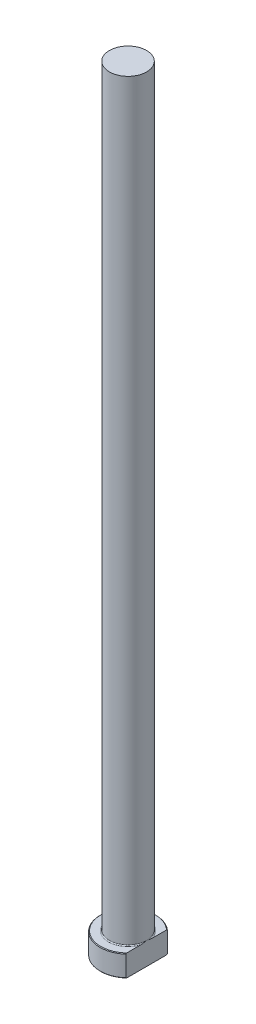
ISO-10303-21;
HEADER;
FILE_DESCRIPTION(('STEP AP214'),'2;1');
FILE_NAME('part.step','',(''),(''),'','','');
FILE_SCHEMA(('AUTOMOTIVE_DESIGN { 1 0 10303 214 1 1 1 1 }'));
ENDSEC;
DATA;
#1=APPLICATION_CONTEXT('core data for automotive mechanical design processes');
#2=APPLICATION_PROTOCOL_DEFINITION('international standard','automotive_design',2000,#1);
#3=PRODUCT_CONTEXT('',#1,'mechanical');
#4=PRODUCT('Part','Part','',(#3));
#5=PRODUCT_RELATED_PRODUCT_CATEGORY('part','',(#4));
#6=PRODUCT_DEFINITION_FORMATION('','',#4);
#7=PRODUCT_DEFINITION_CONTEXT('part definition',#1,'design');
#8=PRODUCT_DEFINITION('design','',#6,#7);
#9=PRODUCT_DEFINITION_SHAPE('','',#8);
#10=(LENGTH_UNIT() NAMED_UNIT(*) SI_UNIT(.MILLI.,.METRE.));
#11=(NAMED_UNIT(*) PLANE_ANGLE_UNIT() SI_UNIT($,.RADIAN.));
#12=(NAMED_UNIT(*) SI_UNIT($,.STERADIAN.) SOLID_ANGLE_UNIT());
#13=UNCERTAINTY_MEASURE_WITH_UNIT(LENGTH_MEASURE(1.E-05),#10,'distance_accuracy_value','');
#14=(GEOMETRIC_REPRESENTATION_CONTEXT(3) GLOBAL_UNCERTAINTY_ASSIGNED_CONTEXT((#13)) GLOBAL_UNIT_ASSIGNED_CONTEXT((#10,
#11,#12)) REPRESENTATION_CONTEXT('',''));
#15=CARTESIAN_POINT('',(0.,0.,0.));
#16=DIRECTION('',(0.,0.,1.));
#17=DIRECTION('',(1.,0.,0.));
#18=AXIS2_PLACEMENT_3D('',#15,#16,#17);
#19=CARTESIAN_POINT('',(0.,0.,0.));
#20=DIRECTION('',(0.,-1.,0.));
#21=DIRECTION('',(0.,0.,-1.));
#22=AXIS2_PLACEMENT_3D('',#19,#20,#21);
#23=PLANE('',#22);
#24=CARTESIAN_POINT('',(0.,0.,0.));
#25=DIRECTION('',(0.,-1.,0.));
#26=DIRECTION('',(0.,0.,-1.));
#27=AXIS2_PLACEMENT_3D('',#24,#25,#26);
#28=CIRCLE('',#27,8.79999999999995);
#29=CARTESIAN_POINT('',(5.99999999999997,0.,6.43739077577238));
#30=VERTEX_POINT('',#29);
#31=CARTESIAN_POINT('',(5.99999999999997,0.,-6.43739077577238));
#32=VERTEX_POINT('',#31);
#33=EDGE_CURVE('E98',#30,#32,#28,.T.);
#34=ORIENTED_EDGE('',*,*,#33,.T.);
#35=DIRECTION('',(0.,0.,1.));
#36=VECTOR('',#35,1.);
#37=CARTESIAN_POINT('',(5.99999999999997,0.,-6.70820393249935));
#38=LINE('',#37,#36);
#39=EDGE_CURVE('E83',#32,#30,#38,.T.);
#40=ORIENTED_EDGE('',*,*,#39,.T.);
#41=EDGE_LOOP('',(#34,#40));
#42=FACE_BOUND('',#41,.T.);
#43=ADVANCED_FACE('F32',(#42),#23,.T.);
#44=CARTESIAN_POINT('',(0.,259.958771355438,0.));
#45=DIRECTION('',(0.,1.,0.));
#46=DIRECTION('',(0.,0.,1.));
#47=AXIS2_PLACEMENT_3D('',#44,#45,#46);
#48=CYLINDRICAL_SURFACE('',#47,8.99999999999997);
#49=CARTESIAN_POINT('',(0.,6.79999999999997,0.));
#50=DIRECTION('',(0.,1.,0.));
#51=DIRECTION('',(0.,0.,1.));
#52=AXIS2_PLACEMENT_3D('',#49,#50,#51);
#53=CIRCLE('',#52,8.99999999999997);
#54=CARTESIAN_POINT('',(5.99999999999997,6.79999999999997,6.70820393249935));
#55=VERTEX_POINT('',#54);
#56=CARTESIAN_POINT('',(5.99999999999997,6.79999999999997,-6.70820393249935));
#57=VERTEX_POINT('',#56);
#58=EDGE_CURVE('E104',#55,#57,#53,.F.);
#59=ORIENTED_EDGE('',*,*,#58,.T.);
#60=DIRECTION('',(0.,-1.,0.));
#61=VECTOR('',#60,1.);
#62=CARTESIAN_POINT('',(5.99999999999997,250.,-6.70820393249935));
#63=LINE('',#62,#61);
#64=CARTESIAN_POINT('',(5.99999999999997,0.200000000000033,-6.70820393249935));
#65=VERTEX_POINT('',#64);
#66=EDGE_CURVE('E183',#57,#65,#63,.T.);
#67=ORIENTED_EDGE('',*,*,#66,.T.);
#68=CARTESIAN_POINT('',(0.,0.200000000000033,0.));
#69=DIRECTION('',(0.,-1.,0.));
#70=DIRECTION('',(0.,0.,-1.));
#71=AXIS2_PLACEMENT_3D('',#68,#69,#70);
#72=CIRCLE('',#71,8.99999999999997);
#73=CARTESIAN_POINT('',(5.99999999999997,0.200000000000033,6.70820393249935));
#74=VERTEX_POINT('',#73);
#75=EDGE_CURVE('E100',#65,#74,#72,.F.);
#76=ORIENTED_EDGE('',*,*,#75,.T.);
#77=DIRECTION('',(0.,-1.,0.));
#78=VECTOR('',#77,1.);
#79=CARTESIAN_POINT('',(5.99999999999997,250.,6.70820393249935));
#80=LINE('',#79,#78);
#81=EDGE_CURVE('E93',#55,#74,#80,.T.);
#82=ORIENTED_EDGE('',*,*,#81,.F.);
#83=EDGE_LOOP('',(#59,#67,#76,#82));
#84=FACE_BOUND('',#83,.T.);
#85=ADVANCED_FACE('F158',(#84),#48,.T.);
#86=CARTESIAN_POINT('',(-8.99999999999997,7.,0.));
#87=DIRECTION('',(0.,1.,0.));
#88=DIRECTION('',(0.,0.,1.));
#89=AXIS2_PLACEMENT_3D('',#86,#87,#88);
#90=PLANE('',#89);
#91=CARTESIAN_POINT('',(0.,7.,0.));
#92=DIRECTION('',(0.,1.,0.));
#93=DIRECTION('',(0.,0.,1.));
#94=AXIS2_PLACEMENT_3D('',#91,#92,#93);
#95=CIRCLE('',#94,8.79999999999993);
#96=CARTESIAN_POINT('',(5.99999999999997,7.,-6.43739077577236));
#97=VERTEX_POINT('',#96);
#98=CARTESIAN_POINT('',(5.99999999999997,7.,6.43739077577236));
#99=VERTEX_POINT('',#98);
#100=EDGE_CURVE('E178',#97,#99,#95,.T.);
#101=ORIENTED_EDGE('',*,*,#100,.T.);
#102=DIRECTION('',(0.,0.,-1.));
#103=VECTOR('',#102,1.);
#104=CARTESIAN_POINT('',(5.99999999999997,7.,0.));
#105=LINE('',#104,#103);
#106=CARTESIAN_POINT('',(5.99999999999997,6.99999999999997,1.92093727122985));
#107=VERTEX_POINT('',#106);
#108=EDGE_CURVE('E57',#99,#107,#105,.T.);
#109=ORIENTED_EDGE('',*,*,#108,.T.);
#110=CARTESIAN_POINT('',(0.,7.,0.));
#111=DIRECTION('',(0.,1.,0.));
#112=DIRECTION('',(0.,0.,1.));
#113=AXIS2_PLACEMENT_3D('',#110,#111,#112);
#114=CIRCLE('',#113,6.29999999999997);
#115=CARTESIAN_POINT('',(5.99999999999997,6.99999999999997,-1.92093727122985));
#116=VERTEX_POINT('',#115);
#117=EDGE_CURVE('E107',#107,#116,#114,.F.);
#118=ORIENTED_EDGE('',*,*,#117,.T.);
#119=EDGE_CURVE('E136',#116,#97,#105,.T.);
#120=ORIENTED_EDGE('',*,*,#119,.T.);
#121=EDGE_LOOP('',(#101,#109,#118,#120));
#122=FACE_BOUND('',#121,.T.);
#123=ADVANCED_FACE('F147',(#122),#90,.T.);
#124=CARTESIAN_POINT('',(0.,7.00000000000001,0.));
#125=DIRECTION('',(0.,-1.,0.));
#126=DIRECTION('',(0.,0.,-1.));
#127=AXIS2_PLACEMENT_3D('',#124,#125,#126);
#128=CONICAL_SURFACE('',#127,8.79999999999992,0.785398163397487);
#129=ORIENTED_EDGE('',*,*,#58,.F.);
#130=CARTESIAN_POINT('',(5.99999999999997,-0.132115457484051,14.7591430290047));
#131=CARTESIAN_POINT('',(5.99999999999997,0.0733919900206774,14.537299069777));
#132=CARTESIAN_POINT('',(5.99999999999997,0.278550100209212,14.3151315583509));
#133=CARTESIAN_POINT('',(5.99999999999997,0.688060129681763,13.8700519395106));
#134=CARTESIAN_POINT('',(5.99999999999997,0.892412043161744,13.647139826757));
#135=CARTESIAN_POINT('',(5.99999999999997,1.50418032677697,12.9770492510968));
#136=CARTESIAN_POINT('',(5.99999999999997,1.91022091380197,12.5286117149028));
#137=CARTESIAN_POINT('',(5.99999999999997,2.71980134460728,11.6246427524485));
#138=CARTESIAN_POINT('',(5.99999999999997,3.12331180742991,11.1690849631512));
#139=CARTESIAN_POINT('',(5.99999999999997,3.92341525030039,10.2520077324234));
#140=CARTESIAN_POINT('',(5.99999999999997,4.32000903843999,9.79048899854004));
#141=CARTESIAN_POINT('',(5.99999999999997,5.02478816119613,8.95241885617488));
#142=CARTESIAN_POINT('',(5.99999999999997,5.33476112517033,8.57737771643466));
#143=CARTESIAN_POINT('',(5.99999999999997,5.79310598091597,8.00939108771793));
#144=CARTESIAN_POINT('',(5.99999999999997,5.94480562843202,7.81913145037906));
#145=CARTESIAN_POINT('',(5.99999999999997,6.24553651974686,7.4365172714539));
#146=CARTESIAN_POINT('',(5.99999999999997,6.39456781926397,7.24416277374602));
#147=CARTESIAN_POINT('',(5.99999999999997,6.68925367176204,6.85721540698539));
#148=CARTESIAN_POINT('',(5.99999999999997,6.83491177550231,6.66262524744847));
#149=CARTESIAN_POINT('',(5.99999999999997,7.12230719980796,6.27057707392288));
#150=CARTESIAN_POINT('',(5.99999999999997,7.26404470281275,6.07311919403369));
#151=CARTESIAN_POINT('',(5.99999999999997,7.54263362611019,5.67488713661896));
#152=CARTESIAN_POINT('',(5.99999999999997,7.67948689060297,5.4741142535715));
#153=CARTESIAN_POINT('',(5.99999999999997,7.94714213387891,5.06858845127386));
#154=CARTESIAN_POINT('',(5.99999999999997,8.07794479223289,4.86383598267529));
#155=CARTESIAN_POINT('',(5.99999999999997,8.32827993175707,4.45554322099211));
#156=CARTESIAN_POINT('',(5.99999999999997,8.44802771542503,4.25213564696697));
#157=CARTESIAN_POINT('',(5.99999999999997,8.6783797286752,3.8401373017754));
#158=CARTESIAN_POINT('',(5.99999999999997,8.78898293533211,3.63154595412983));
#159=CARTESIAN_POINT('',(5.99999999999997,8.99840984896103,3.20863811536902));
#160=CARTESIAN_POINT('',(5.99999999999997,9.09724073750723,2.99432521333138));
#161=CARTESIAN_POINT('',(5.99999999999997,9.27991776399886,2.55937061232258));
#162=CARTESIAN_POINT('',(5.99999999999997,9.36376811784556,2.33873071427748));
#163=CARTESIAN_POINT('',(5.99999999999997,9.49627737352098,1.94012294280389));
#164=CARTESIAN_POINT('',(5.99999999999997,9.5486217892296,1.76338731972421));
#165=CARTESIAN_POINT('',(5.99999999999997,9.639780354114,1.40643307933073));
#166=CARTESIAN_POINT('',(5.99999999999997,9.67859618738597,1.22621489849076));
#167=CARTESIAN_POINT('',(5.99999999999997,9.7407731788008,0.863704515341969));
#168=CARTESIAN_POINT('',(5.99999999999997,9.76418479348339,0.681421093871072));
#169=CARTESIAN_POINT('',(5.99999999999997,9.79447814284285,0.315473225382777));
#170=CARTESIAN_POINT('',(5.99999999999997,9.80136083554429,0.131808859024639));
#171=CARTESIAN_POINT('',(5.99999999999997,9.79818788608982,-0.235881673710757));
#172=CARTESIAN_POINT('',(5.99999999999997,9.78808514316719,-0.419907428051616));
#173=CARTESIAN_POINT('',(5.99999999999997,9.75144464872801,-0.786302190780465));
#174=CARTESIAN_POINT('',(5.99999999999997,9.7249055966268,-0.968671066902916));
#175=CARTESIAN_POINT('',(5.99999999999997,9.65670736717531,-1.33110767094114));
#176=CARTESIAN_POINT('',(5.99999999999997,9.6150012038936,-1.5111664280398));
#177=CARTESIAN_POINT('',(5.99999999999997,9.51838325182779,-1.86766519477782));
#178=CARTESIAN_POINT('',(5.99999999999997,9.46347085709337,-2.04410503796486));
#179=CARTESIAN_POINT('',(5.99999999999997,9.33563659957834,-2.41270922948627));
#180=CARTESIAN_POINT('',(5.99999999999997,9.26138327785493,-2.60440790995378));
#181=CARTESIAN_POINT('',(5.99999999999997,9.10155310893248,-2.9830649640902));
#182=CARTESIAN_POINT('',(5.99999999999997,9.01597146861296,-3.17002129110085));
#183=CARTESIAN_POINT('',(5.99999999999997,8.8355347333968,-3.53975380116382));
#184=CARTESIAN_POINT('',(5.99999999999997,8.74066449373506,-3.72252253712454));
#185=CARTESIAN_POINT('',(5.99999999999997,8.54355472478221,-4.08398624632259));
#186=CARTESIAN_POINT('',(5.99999999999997,8.4413161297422,-4.26268173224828));
#187=CARTESIAN_POINT('',(5.99999999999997,8.22953960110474,-4.61872309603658));
#188=CARTESIAN_POINT('',(5.99999999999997,8.11992610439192,-4.79602381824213));
#189=CARTESIAN_POINT('',(5.99999999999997,7.89571048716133,-5.14743548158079));
#190=CARTESIAN_POINT('',(5.99999999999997,7.78110825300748,-5.32154634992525));
#191=CARTESIAN_POINT('',(5.99999999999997,7.54792782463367,-5.66682327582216));
#192=CARTESIAN_POINT('',(5.99999999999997,7.42935372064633,-5.83799210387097));
#193=CARTESIAN_POINT('',(5.99999999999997,7.18881616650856,-6.17793707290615));
#194=CARTESIAN_POINT('',(5.99999999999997,7.0668525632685,-6.34671310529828));
#195=CARTESIAN_POINT('',(5.99999999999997,6.80539778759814,-6.70216781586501));
#196=CARTESIAN_POINT('',(5.99999999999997,6.66554966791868,-6.88858356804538));
#197=CARTESIAN_POINT('',(5.99999999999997,6.38292065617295,-7.25918139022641));
#198=CARTESIAN_POINT('',(5.99999999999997,6.24013967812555,-7.44336339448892));
#199=CARTESIAN_POINT('',(5.99999999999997,5.80812002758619,-7.99307414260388));
#200=CARTESIAN_POINT('',(5.99999999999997,5.51523002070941,-8.35573349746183));
#201=CARTESIAN_POINT('',(5.99999999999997,4.92224619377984,-9.07562940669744));
#202=CARTESIAN_POINT('',(5.99999999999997,4.6221460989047,-9.432860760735));
#203=CARTESIAN_POINT('',(5.99999999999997,4.01677382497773,-10.1429201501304));
#204=CARTESIAN_POINT('',(5.99999999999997,3.71150152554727,-10.4957480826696));
#205=CARTESIAN_POINT('',(5.99999999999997,3.11456796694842,-11.1779164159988));
#206=CARTESIAN_POINT('',(5.99999999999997,2.82312451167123,-11.5074478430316));
#207=CARTESIAN_POINT('',(5.99999999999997,2.2374718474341,-12.164052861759));
#208=CARTESIAN_POINT('',(5.99999999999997,1.94326258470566,-12.491126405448));
#209=CARTESIAN_POINT('',(5.99999999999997,1.35320776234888,-13.1426363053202));
#210=CARTESIAN_POINT('',(5.99999999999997,1.0573664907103,-13.4670765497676));
#211=CARTESIAN_POINT('',(5.99999999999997,0.463882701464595,-14.1142803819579));
#212=CARTESIAN_POINT('',(5.99999999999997,0.166240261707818,-14.4370440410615));
#213=CARTESIAN_POINT('',(5.99999999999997,-0.132115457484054,-14.7591430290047));
#214=B_SPLINE_CURVE_WITH_KNOTS('',3,(#130,#131,#132,#133,#134,#135,#136,#137,#138,#139,#140,
#141,#142,#143,#144,#145,#146,#147,#148,#149,#150,#151,#152,#153,#154,#155,#156,#157,#158,#159,
#160,#161,#162,#163,#164,#165,#166,#167,#168,#169,#170,#171,#172,#173,#174,#175,#176,#177,#178,
#179,#180,#181,#182,#183,#184,#185,#186,#187,#188,#189,#190,#191,#192,#193,#194,#195,#196,#197,
#198,#199,#200,#201,#202,#203,#204,#205,#206,#207,#208,#209,#210,#211,#212,#213),.UNSPECIFIED.,
.F.,.F.,(4,2,2,2,2,2,2,2,2,2,2,2,2,2,2,2,2,2,2,2,2,2,2,2,2,2,2,2,2,2,2,2,2,2,2,2,2,2,2,2,2,4),
(0.,0.907210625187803,1.81442776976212,3.62925156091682,5.45490487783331,7.28034345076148,
8.73990838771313,9.46989218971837,10.1998607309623,10.9290223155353,11.6581499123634,
12.3869992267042,13.1157664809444,13.8236973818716,14.531707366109,15.2392832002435,
15.946659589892,16.4991819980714,17.0516356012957,17.6022705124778,18.152873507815,
18.7050058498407,19.2571818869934,19.811083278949,20.3650100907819,20.9812908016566,
21.5978331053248,22.2153979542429,22.8328846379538,23.4581285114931,24.0833866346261,
24.7080195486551,25.3326807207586,26.0317691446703,26.7308780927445,28.1292235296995,
29.5288334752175,30.9284760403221,32.2482200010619,33.5679896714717,34.8851960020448,
36.2023458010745),.UNSPECIFIED.);
#215=EDGE_CURVE('E135',#55,#99,#214,.T.);
#216=ORIENTED_EDGE('',*,*,#215,.T.);
#217=ORIENTED_EDGE('',*,*,#100,.F.);
#218=EDGE_CURVE('E127',#97,#57,#214,.T.);
#219=ORIENTED_EDGE('',*,*,#218,.T.);
#220=EDGE_LOOP('',(#129,#216,#217,#219));
#221=FACE_BOUND('',#220,.T.);
#222=ADVANCED_FACE('F143',(#221),#128,.T.);
#223=CARTESIAN_POINT('',(0.,0.200000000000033,0.));
#224=DIRECTION('',(0.,1.,0.));
#225=DIRECTION('',(0.,0.,1.));
#226=AXIS2_PLACEMENT_3D('',#223,#224,#225);
#227=CONICAL_SURFACE('',#226,8.99999999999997,0.785398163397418);
#228=ORIENTED_EDGE('',*,*,#75,.F.);
#229=CARTESIAN_POINT('',(5.99999999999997,7.13211545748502,-14.7591430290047));
#230=CARTESIAN_POINT('',(5.99999999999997,6.92660800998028,-14.537299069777));
#231=CARTESIAN_POINT('',(5.99999999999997,6.72144989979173,-14.315131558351));
#232=CARTESIAN_POINT('',(5.99999999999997,6.31193987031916,-13.8700519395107));
#233=CARTESIAN_POINT('',(5.99999999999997,6.10758795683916,-13.6471398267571));
#234=CARTESIAN_POINT('',(5.99999999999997,5.4958196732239,-12.9770492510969));
#235=CARTESIAN_POINT('',(5.99999999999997,5.08977908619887,-12.5286117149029));
#236=CARTESIAN_POINT('',(5.99999999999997,4.28019865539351,-11.6246427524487));
#237=CARTESIAN_POINT('',(5.99999999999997,3.87668819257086,-11.1690849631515));
#238=CARTESIAN_POINT('',(5.99999999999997,3.07658474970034,-10.2520077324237));
#239=CARTESIAN_POINT('',(5.99999999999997,2.67999096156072,-9.79048899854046));
#240=CARTESIAN_POINT('',(5.99999999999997,1.97521183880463,-8.95241885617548));
#241=CARTESIAN_POINT('',(5.99999999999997,1.66523887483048,-8.5773777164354));
#242=CARTESIAN_POINT('',(5.99999999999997,1.20689401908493,-8.00939108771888));
#243=CARTESIAN_POINT('',(5.99999999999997,1.05519437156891,-7.81913145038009));
#244=CARTESIAN_POINT('',(5.99999999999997,0.754463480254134,-7.43651727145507));
#245=CARTESIAN_POINT('',(5.99999999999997,0.60543218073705,-7.24416277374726));
#246=CARTESIAN_POINT('',(5.99999999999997,0.310746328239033,-6.85721540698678));
#247=CARTESIAN_POINT('',(5.99999999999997,0.165088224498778,-6.66262524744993));
#248=CARTESIAN_POINT('',(5.99999999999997,-0.122307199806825,-6.2705770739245));
#249=CARTESIAN_POINT('',(5.99999999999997,-0.2640447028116,-6.07311919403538));
#250=CARTESIAN_POINT('',(5.99999999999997,-0.542633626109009,-5.67488713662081));
#251=CARTESIAN_POINT('',(5.99999999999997,-0.679486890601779,-5.47411425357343));
#252=CARTESIAN_POINT('',(5.99999999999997,-0.947142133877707,-5.06858845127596));
#253=CARTESIAN_POINT('',(5.99999999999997,-1.07794479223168,-4.86383598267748));
#254=CARTESIAN_POINT('',(5.99999999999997,-1.32827993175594,-4.45554322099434));
#255=CARTESIAN_POINT('',(5.99999999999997,-1.44802771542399,-4.25213564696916));
#256=CARTESIAN_POINT('',(5.99999999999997,-1.67837972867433,-3.8401373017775));
#257=CARTESIAN_POINT('',(5.99999999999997,-1.78898293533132,-3.63154595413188));
#258=CARTESIAN_POINT('',(5.99999999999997,-1.99840984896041,-3.20863811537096));
#259=CARTESIAN_POINT('',(5.99999999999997,-2.0972407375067,-2.99432521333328));
#260=CARTESIAN_POINT('',(5.99999999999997,-2.2799177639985,-2.55937061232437));
#261=CARTESIAN_POINT('',(5.99999999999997,-2.36376811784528,-2.33873071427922));
#262=CARTESIAN_POINT('',(5.99999999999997,-2.49627737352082,-1.94012294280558));
#263=CARTESIAN_POINT('',(5.99999999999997,-2.54862178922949,-1.76338731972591));
#264=CARTESIAN_POINT('',(5.99999999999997,-2.63978035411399,-1.40643307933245));
#265=CARTESIAN_POINT('',(5.99999999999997,-2.67859618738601,-1.22621489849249));
#266=CARTESIAN_POINT('',(5.99999999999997,-2.74077317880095,-0.863704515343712));
#267=CARTESIAN_POINT('',(5.99999999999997,-2.7641847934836,-0.681421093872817));
#268=CARTESIAN_POINT('',(5.99999999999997,-2.79447814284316,-0.315473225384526));
#269=CARTESIAN_POINT('',(5.99999999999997,-2.80136083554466,-0.131808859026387));
#270=CARTESIAN_POINT('',(5.99999999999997,-2.7981878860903,0.23588167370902));
#271=CARTESIAN_POINT('',(5.99999999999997,-2.78808514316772,0.419907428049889));
#272=CARTESIAN_POINT('',(5.99999999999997,-2.75144464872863,0.786302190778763));
#273=CARTESIAN_POINT('',(5.99999999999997,-2.72490559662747,0.968671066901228));
#274=CARTESIAN_POINT('',(5.99999999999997,-2.65670736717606,1.33110767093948));
#275=CARTESIAN_POINT('',(5.99999999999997,-2.61500120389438,1.51116642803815));
#276=CARTESIAN_POINT('',(5.99999999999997,-2.51838325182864,1.8676651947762));
#277=CARTESIAN_POINT('',(5.99999999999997,-2.46347085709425,2.04410503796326));
#278=CARTESIAN_POINT('',(5.99999999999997,-2.33563659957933,2.41270922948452));
#279=CARTESIAN_POINT('',(5.99999999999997,-2.26138327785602,2.60440790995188));
#280=CARTESIAN_POINT('',(5.99999999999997,-2.10155310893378,2.98306496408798));
#281=CARTESIAN_POINT('',(5.99999999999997,-2.01597146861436,3.17002129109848));
#282=CARTESIAN_POINT('',(5.99999999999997,-1.83553473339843,3.53975380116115));
#283=CARTESIAN_POINT('',(5.99999999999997,-1.74066449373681,3.72252253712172));
#284=CARTESIAN_POINT('',(5.99999999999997,-1.5435547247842,4.08398624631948));
#285=CARTESIAN_POINT('',(5.99999999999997,-1.44131612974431,4.26268173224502));
#286=CARTESIAN_POINT('',(5.99999999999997,-1.22953960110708,4.61872309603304));
#287=CARTESIAN_POINT('',(5.99999999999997,-1.11992610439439,4.79602381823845));
#288=CARTESIAN_POINT('',(5.99999999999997,-0.895710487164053,5.14743548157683));
#289=CARTESIAN_POINT('',(5.99999999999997,-0.781108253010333,5.32154634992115));
#290=CARTESIAN_POINT('',(5.99999999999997,-0.547927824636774,5.66682327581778));
#291=CARTESIAN_POINT('',(5.99999999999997,-0.429353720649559,5.83799210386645));
#292=CARTESIAN_POINT('',(5.99999999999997,-0.188816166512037,6.17793707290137));
#293=CARTESIAN_POINT('',(5.99999999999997,-0.0668525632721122,6.34671310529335));
#294=CARTESIAN_POINT('',(5.99999999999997,0.194602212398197,6.7021678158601));
#295=CARTESIAN_POINT('',(5.99999999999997,0.334450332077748,6.88858356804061));
#296=CARTESIAN_POINT('',(5.99999999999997,0.617079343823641,7.25918139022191));
#297=CARTESIAN_POINT('',(5.99999999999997,0.759860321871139,7.44336339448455));
#298=CARTESIAN_POINT('',(5.99999999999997,1.19187997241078,7.99307414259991));
#299=CARTESIAN_POINT('',(5.99999999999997,1.48476997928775,8.35573349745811));
#300=CARTESIAN_POINT('',(5.99999999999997,2.07775380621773,9.07562940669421));
#301=CARTESIAN_POINT('',(5.99999999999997,2.37785390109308,9.43286076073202));
#302=CARTESIAN_POINT('',(5.99999999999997,2.9832261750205,10.1429201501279));
#303=CARTESIAN_POINT('',(5.99999999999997,3.28849847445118,10.4957480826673));
#304=CARTESIAN_POINT('',(5.99999999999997,3.88543203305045,11.1779164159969));
#305=CARTESIAN_POINT('',(5.99999999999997,4.17687548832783,11.5074478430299));
#306=CARTESIAN_POINT('',(5.99999999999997,4.76252815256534,12.1640528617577));
#307=CARTESIAN_POINT('',(5.99999999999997,5.05673741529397,12.4911264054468));
#308=CARTESIAN_POINT('',(5.99999999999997,5.64679223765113,13.1426363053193));
#309=CARTESIAN_POINT('',(5.99999999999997,5.9426335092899,13.4670765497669));
#310=CARTESIAN_POINT('',(5.99999999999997,6.53611729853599,14.1142803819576));
#311=CARTESIAN_POINT('',(5.99999999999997,6.83375973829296,14.4370440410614));
#312=CARTESIAN_POINT('',(5.99999999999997,7.13211545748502,14.7591430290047));
#313=B_SPLINE_CURVE_WITH_KNOTS('',3,(#229,#230,#231,#232,#233,#234,#235,#236,#237,#238,#239,
#240,#241,#242,#243,#244,#245,#246,#247,#248,#249,#250,#251,#252,#253,#254,#255,#256,#257,#258,
#259,#260,#261,#262,#263,#264,#265,#266,#267,#268,#269,#270,#271,#272,#273,#274,#275,#276,#277,
#278,#279,#280,#281,#282,#283,#284,#285,#286,#287,#288,#289,#290,#291,#292,#293,#294,#295,#296,
#297,#298,#299,#300,#301,#302,#303,#304,#305,#306,#307,#308,#309,#310,#311,#312),.UNSPECIFIED.,
.F.,.F.,(4,2,2,2,2,2,2,2,2,2,2,2,2,2,2,2,2,2,2,2,2,2,2,2,2,2,2,2,2,2,2,2,2,2,2,2,2,2,2,2,2,4),
(0.,0.907210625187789,1.81442776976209,3.62925156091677,5.45490487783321,7.28034345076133,
8.73990838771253,9.46989218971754,10.1998607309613,10.9290223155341,11.6581499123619,
12.3869992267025,13.1157664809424,13.82369738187,14.5317073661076,15.2392832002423,
15.9466595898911,16.4991819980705,17.0516356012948,17.6022705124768,18.1528735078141,
18.7050058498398,19.2571818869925,19.8110832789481,20.365010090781,20.9812908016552,
21.5978331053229,22.2153979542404,22.8328846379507,23.4581285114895,24.083386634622,
24.7080195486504,25.3326807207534,26.0317691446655,26.7308780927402,28.1292235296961,
29.5288334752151,30.9284760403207,32.2482200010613,33.5679896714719,34.8851960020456,
36.2023458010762),.UNSPECIFIED.);
#314=EDGE_CURVE('E86',#65,#32,#313,.T.);
#315=ORIENTED_EDGE('',*,*,#314,.T.);
#316=ORIENTED_EDGE('',*,*,#33,.F.);
#317=EDGE_CURVE('E89',#30,#74,#313,.T.);
#318=ORIENTED_EDGE('',*,*,#317,.T.);
#319=EDGE_LOOP('',(#228,#315,#316,#318));
#320=FACE_BOUND('',#319,.T.);
#321=ADVANCED_FACE('F97',(#320),#227,.T.);
#322=CARTESIAN_POINT('',(0.,7.29999999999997,0.));
#323=DIRECTION('',(0.,1.,0.));
#324=DIRECTION('',(0.,0.,1.));
#325=AXIS2_PLACEMENT_3D('',#322,#323,#324);
#326=TOROIDAL_SURFACE('',#325,6.29999999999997,0.3);
#327=CARTESIAN_POINT('',(5.99999999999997,7.29999999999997,0.));
#328=CARTESIAN_POINT('',(5.99999999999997,7.30000062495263,1.34604287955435E-10));
#329=CARTESIAN_POINT('',(5.99999999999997,7.30000124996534,-2.85495107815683E-07));
#330=CARTESIAN_POINT('',(5.99999999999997,7.30000241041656,-1.04928090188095E-06));
#331=CARTESIAN_POINT('',(5.99999999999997,7.30000292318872,-1.54785170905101E-06));
#332=CARTESIAN_POINT('',(5.99999999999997,7.30000401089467,-2.74944383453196E-06));
#333=CARTESIAN_POINT('',(5.99999999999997,7.30000456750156,-3.47196539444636E-06));
#334=CARTESIAN_POINT('',(5.99999999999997,7.30000554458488,-4.95172582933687E-06));
#335=CARTESIAN_POINT('',(5.99999999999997,7.30000596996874,-5.70604365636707E-06));
#336=CARTESIAN_POINT('',(5.99999999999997,7.30000759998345,-8.69525109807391E-06));
#337=CARTESIAN_POINT('',(5.99999999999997,7.30000872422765,-1.0978182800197E-05));
#338=CARTESIAN_POINT('',(5.99999999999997,7.30001052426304,-1.54456346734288E-05));
#339=CARTESIAN_POINT('',(5.99999999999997,7.3000112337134,-1.76170762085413E-05));
#340=CARTESIAN_POINT('',(5.99999999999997,7.30001429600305,-2.69928123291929E-05));
#341=CARTESIAN_POINT('',(5.99999999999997,7.30001664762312,-3.42000265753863E-05));
#342=CARTESIAN_POINT('',(5.99999999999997,7.30002002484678,-4.76829001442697E-05));
#343=CARTESIAN_POINT('',(5.99999999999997,7.30002120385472,-5.39195609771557E-05));
#344=CARTESIAN_POINT('',(5.99999999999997,7.30002992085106,-0.000100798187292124));
#345=CARTESIAN_POINT('',(5.99999999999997,7.30003667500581,-0.00014152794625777));
#346=CARTESIAN_POINT('',(5.99999999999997,7.30006623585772,-0.000303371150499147));
#347=CARTESIAN_POINT('',(5.99999999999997,7.30009428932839,-0.000423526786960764));
#348=CARTESIAN_POINT('',(5.99999999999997,7.30020425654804,-0.000901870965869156));
#349=CARTESIAN_POINT('',(5.99999999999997,7.3002828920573,-0.00126055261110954));
#350=CARTESIAN_POINT('',(5.99999999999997,7.30059934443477,-0.0026940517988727));
#351=CARTESIAN_POINT('',(5.99999999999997,7.3008413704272,-0.0037682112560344));
#352=CARTESIAN_POINT('',(5.99999999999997,7.30185255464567,-0.0082672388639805));
#353=CARTESIAN_POINT('',(5.99999999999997,7.30261638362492,-0.0116929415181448));
#354=CARTESIAN_POINT('',(5.99999999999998,7.30945824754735,-0.0423635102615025));
#355=CARTESIAN_POINT('',(5.99999999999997,7.31555811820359,-0.0696050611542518));
#356=CARTESIAN_POINT('',(5.99999999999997,7.32747716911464,-0.122985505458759));
#357=CARTESIAN_POINT('',(5.99999999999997,7.33329766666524,-0.149124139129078));
#358=CARTESIAN_POINT('',(5.99999999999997,7.34565922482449,-0.204790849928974));
#359=CARTESIAN_POINT('',(5.99999999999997,7.352196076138,-0.234319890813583));
#360=CARTESIAN_POINT('',(5.99999999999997,7.36527652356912,-0.29372170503));
#361=CARTESIAN_POINT('',(5.99999999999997,7.37181938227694,-0.323594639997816));
#362=CARTESIAN_POINT('',(5.99999999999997,7.38741819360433,-0.395325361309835));
#363=CARTESIAN_POINT('',(5.99999999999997,7.39643140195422,-0.437192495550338));
#364=CARTESIAN_POINT('',(5.99999999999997,7.41397520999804,-0.519837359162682));
#365=CARTESIAN_POINT('',(5.99999999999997,7.4225122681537,-0.560613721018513));
#366=CARTESIAN_POINT('',(5.99999999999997,7.45005469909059,-0.694529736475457));
#367=CARTESIAN_POINT('',(5.99999999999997,7.46845270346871,-0.787796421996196));
#368=CARTESIAN_POINT('',(5.99999999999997,7.50309772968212,-0.975673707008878));
#369=CARTESIAN_POINT('',(5.99999999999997,7.51932210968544,-1.07028855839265));
#370=CARTESIAN_POINT('',(5.99999999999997,7.54979671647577,-1.26922112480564));
#371=CARTESIAN_POINT('',(5.99999999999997,7.56370439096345,-1.37359247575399));
#372=CARTESIAN_POINT('',(5.99999999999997,7.58567213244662,-1.58267692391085));
#373=CARTESIAN_POINT('',(5.99999999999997,7.59375049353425,-1.68738790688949));
#374=CARTESIAN_POINT('',(5.99999999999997,7.59943466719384,-1.8430899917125));
#375=CARTESIAN_POINT('',(5.99999999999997,7.60029184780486,-1.89396002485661));
#376=CARTESIAN_POINT('',(5.99999999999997,7.5995288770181,-1.99574511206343));
#377=CARTESIAN_POINT('',(5.99999999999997,7.59790613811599,-2.04666015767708));
#378=CARTESIAN_POINT('',(5.99999999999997,7.59158346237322,-2.14740525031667));
#379=CARTESIAN_POINT('',(5.99999999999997,7.58693864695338,-2.19723851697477));
#380=CARTESIAN_POINT('',(5.99999999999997,7.57369485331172,-2.29634018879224));
#381=CARTESIAN_POINT('',(5.99999999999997,7.56510170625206,-2.3456093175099));
#382=CARTESIAN_POINT('',(5.99999999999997,7.54513600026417,-2.43101613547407));
#383=CARTESIAN_POINT('',(5.99999999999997,7.53495732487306,-2.46741817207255));
#384=CARTESIAN_POINT('',(5.99999999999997,7.5163599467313,-2.52083307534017));
#385=CARTESIAN_POINT('',(5.99999999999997,7.50961541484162,-2.53842082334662));
#386=CARTESIAN_POINT('',(5.99999999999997,7.49476050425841,-2.57300282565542));
#387=CARTESIAN_POINT('',(5.99999999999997,7.48665036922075,-2.58999718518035));
#388=CARTESIAN_POINT('',(5.99999999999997,7.4656679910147,-2.62872971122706));
#389=CARTESIAN_POINT('',(5.99999999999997,7.45211281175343,-2.65012863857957));
#390=CARTESIAN_POINT('',(5.99999999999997,7.42848584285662,-2.67978235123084));
#391=CARTESIAN_POINT('',(5.99999999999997,7.42001211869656,-2.68929941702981));
#392=CARTESIAN_POINT('',(5.99999999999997,7.40175979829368,-2.70700164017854));
#393=CARTESIAN_POINT('',(5.99999999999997,7.39198420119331,-2.71518976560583));
#394=CARTESIAN_POINT('',(5.99999999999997,7.37475773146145,-2.7269570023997));
#395=CARTESIAN_POINT('',(5.99999999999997,7.36772137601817,-2.73113834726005));
#396=CARTESIAN_POINT('',(5.99999999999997,7.35309194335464,-2.73838811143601));
#397=CARTESIAN_POINT('',(5.99999999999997,7.34549938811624,-2.7414575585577));
#398=CARTESIAN_POINT('',(5.99999999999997,7.32979919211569,-2.74623687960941));
#399=CARTESIAN_POINT('',(5.99999999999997,7.32168697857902,-2.74793213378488));
#400=CARTESIAN_POINT('',(5.99999999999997,7.30528814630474,-2.74970225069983));
#401=CARTESIAN_POINT('',(5.99999999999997,7.29700168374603,-2.74977850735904));
#402=CARTESIAN_POINT('',(5.99999999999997,7.2816016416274,-2.74839814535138));
#403=CARTESIAN_POINT('',(5.99999999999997,7.27447007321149,-2.74713049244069));
#404=CARTESIAN_POINT('',(5.99999999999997,7.26050316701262,-2.74347158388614));
#405=CARTESIAN_POINT('',(5.99999999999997,7.25366802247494,-2.7410796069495));
#406=CARTESIAN_POINT('',(5.99999999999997,7.23783277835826,-2.73423902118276));
#407=CARTESIAN_POINT('',(5.99999999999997,7.22902314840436,-2.72935244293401));
#408=CARTESIAN_POINT('',(5.99999999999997,7.21228574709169,-2.7182516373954));
#409=CARTESIAN_POINT('',(5.99999999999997,7.20436026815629,-2.71203407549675));
#410=CARTESIAN_POINT('',(5.99999999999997,7.18433696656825,-2.69420240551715));
#411=CARTESIAN_POINT('',(5.99999999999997,7.17298706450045,-2.68175715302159));
#412=CARTESIAN_POINT('',(5.99999999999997,7.15219498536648,-2.65539556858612));
#413=CARTESIAN_POINT('',(5.99999999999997,7.14275658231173,-2.64147640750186));
#414=CARTESIAN_POINT('',(5.99999999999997,7.12508934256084,-2.61223187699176));
#415=CARTESIAN_POINT('',(5.99999999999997,7.11691464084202,-2.59687428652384));
#416=CARTESIAN_POINT('',(5.99999999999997,7.10186133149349,-2.56552911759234));
#417=CARTESIAN_POINT('',(5.99999999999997,7.09498416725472,-2.54954086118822));
#418=CARTESIAN_POINT('',(5.99999999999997,7.07586257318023,-2.50075322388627));
#419=CARTESIAN_POINT('',(5.99999999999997,7.06523495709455,-2.46732486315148));
#420=CARTESIAN_POINT('',(5.99999999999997,7.04175411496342,-2.38014114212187));
#421=CARTESIAN_POINT('',(5.99999999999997,7.0311656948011,-2.32580591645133));
#422=CARTESIAN_POINT('',(5.99999999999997,7.01502027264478,-2.21628778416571));
#423=CARTESIAN_POINT('',(5.99999999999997,7.00947977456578,-2.16110269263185));
#424=CARTESIAN_POINT('',(5.99999999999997,7.00227593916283,-2.05225433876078));
#425=CARTESIAN_POINT('',(5.99999999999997,7.00049528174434,-1.99859827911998));
#426=CARTESIAN_POINT('',(5.99999999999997,6.99968738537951,-1.89155586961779));
#427=CARTESIAN_POINT('',(5.99999999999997,7.00064591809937,-1.83816956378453));
#428=CARTESIAN_POINT('',(5.99999999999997,7.00516082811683,-1.72092619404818));
#429=CARTESIAN_POINT('',(5.99999999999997,7.0091939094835,-1.65708843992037));
#430=CARTESIAN_POINT('',(5.99999999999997,7.01973827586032,-1.52965474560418));
#431=CARTESIAN_POINT('',(5.99999999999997,7.02624848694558,-1.46605871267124));
#432=CARTESIAN_POINT('',(5.99999999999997,7.04143114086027,-1.33760082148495));
#433=CARTESIAN_POINT('',(5.99999999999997,7.05015116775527,-1.27274468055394));
#434=CARTESIAN_POINT('',(5.99999999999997,7.06927542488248,-1.14310871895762));
#435=CARTESIAN_POINT('',(5.99999999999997,7.07968406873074,-1.07832955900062));
#436=CARTESIAN_POINT('',(5.99999999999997,7.10594320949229,-0.924890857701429));
#437=CARTESIAN_POINT('',(5.99999999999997,7.12237584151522,-0.836331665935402));
#438=CARTESIAN_POINT('',(5.99999999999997,7.15676035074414,-0.660568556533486));
#439=CARTESIAN_POINT('',(5.99999999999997,7.17469265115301,-0.573360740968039));
#440=CARTESIAN_POINT('',(5.99999999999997,7.20946366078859,-0.409309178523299));
#441=CARTESIAN_POINT('',(5.99999999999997,7.22618667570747,-0.332440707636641));
#442=CARTESIAN_POINT('',(5.99999999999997,7.25202386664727,-0.215187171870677));
#443=CARTESIAN_POINT('',(5.99999999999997,7.26098977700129,-0.174768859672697));
#444=CARTESIAN_POINT('',(5.99999999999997,7.27885525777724,-0.0946083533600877));
#445=CARTESIAN_POINT('',(5.99999999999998,7.28775352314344,-0.0548658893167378));
#446=CARTESIAN_POINT('',(5.99999999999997,7.2973853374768,-0.0116849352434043));
#447=CARTESIAN_POINT('',(5.99999999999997,7.29815099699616,-0.0082512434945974));
#448=CARTESIAN_POINT('',(5.99999999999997,7.2991626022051,-0.00375043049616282));
#449=CARTESIAN_POINT('',(5.99999999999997,7.29940322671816,-0.00268247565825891));
#450=CARTESIAN_POINT('',(5.99999999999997,7.29971797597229,-0.0012566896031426));
#451=CARTESIAN_POINT('',(5.99999999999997,7.2997962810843,-0.000899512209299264));
#452=CARTESIAN_POINT('',(5.99999999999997,7.2999058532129,-0.000422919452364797));
#453=CARTESIAN_POINT('',(5.99999999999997,7.29993385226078,-0.000303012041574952));
#454=CARTESIAN_POINT('',(5.99999999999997,7.299963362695,-0.000141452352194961));
#455=CARTESIAN_POINT('',(5.99999999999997,7.29997011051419,-0.000100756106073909));
#456=CARTESIAN_POINT('',(5.99999999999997,7.29997881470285,-5.39118915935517E-05));
#457=CARTESIAN_POINT('',(5.99999999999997,7.29997999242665,-4.76769647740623E-05));
#458=CARTESIAN_POINT('',(5.99999999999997,7.29998336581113,-3.41977669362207E-05));
#459=CARTESIAN_POINT('',(5.99999999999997,7.29998571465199,-2.69924043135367E-05));
#460=CARTESIAN_POINT('',(5.99999999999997,7.29998877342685,-1.76186229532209E-05));
#461=CARTESIAN_POINT('',(5.99999999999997,7.29998948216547,-1.54473107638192E-05));
#462=CARTESIAN_POINT('',(5.99999999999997,7.29999128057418,-1.09800124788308E-05));
#463=CARTESIAN_POINT('',(5.99999999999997,7.29999240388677,-8.69708706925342E-06));
#464=CARTESIAN_POINT('',(5.99999999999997,7.29999403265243,-5.70776681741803E-06));
#465=CARTESIAN_POINT('',(5.99999999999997,7.29999445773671,-4.95337952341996E-06));
#466=CARTESIAN_POINT('',(5.99999999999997,7.29999543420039,-3.47342608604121E-06));
#467=CARTESIAN_POINT('',(5.99999999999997,7.29999599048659,-2.7507782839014E-06));
#468=CARTESIAN_POINT('',(5.99999999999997,7.29999707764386,-1.54889527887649E-06));
#469=CARTESIAN_POINT('',(5.99999999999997,7.29999759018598,-1.0501721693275E-06));
#470=CARTESIAN_POINT('',(5.99999999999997,7.29999875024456,-2.85992424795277E-07));
#471=CARTESIAN_POINT('',(5.99999999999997,7.29999937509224,-1.34594612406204E-10));
#472=CARTESIAN_POINT('',(5.99999999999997,7.29999999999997,0.));
#473=B_SPLINE_CURVE_WITH_KNOTS('',3,(#327,#328,#329,#330,#331,#332,#333,#334,#335,#336,#337,
#338,#339,#340,#341,#342,#343,#344,#345,#346,#347,#348,#349,#350,#351,#352,#353,#354,#355,#356,
#357,#358,#359,#360,#361,#362,#363,#364,#365,#366,#367,#368,#369,#370,#371,#372,#373,#374,#375,
#376,#377,#378,#379,#380,#381,#382,#383,#384,#385,#386,#387,#388,#389,#390,#391,#392,#393,#394,
#395,#396,#397,#398,#399,#400,#401,#402,#403,#404,#405,#406,#407,#408,#409,#410,#411,#412,#413,
#414,#415,#416,#417,#418,#419,#420,#421,#422,#423,#424,#425,#426,#427,#428,#429,#430,#431,#432,
#433,#434,#435,#436,#437,#438,#439,#440,#441,#442,#443,#444,#445,#446,#447,#448,#449,#450,#451,
#452,#453,#454,#455,#456,#457,#458,#459,#460,#461,#462,#463,#464,#465,#466,#467,#468,#469,#470,
#471,#472),.UNSPECIFIED.,.T.,.F.,(4,2,2,2,2,2,2,2,2,2,2,2,2,2,2,2,2,2,2,2,2,2,2,2,2,2,2,2,2,2,2,
2,2,2,2,2,2,2,2,2,2,2,2,2,2,2,2,2,2,2,2,2,2,2,2,2,2,2,2,2,2,2,2,2,2,2,2,2,2,2,2,2,4),(0.,
1.90630853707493E-06,4.0638928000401E-06,6.78060422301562E-06,9.37792731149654E-06,
1.69875448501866E-05,2.38342815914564E-05,4.65460519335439E-05,6.55661832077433E-05,
0.000189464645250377,0.000559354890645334,0.001661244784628,0.00496415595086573,
0.0154940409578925,0.0992404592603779,0.179577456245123,0.270309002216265,0.362052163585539,
0.490530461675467,0.615511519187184,0.900684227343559,1.1886283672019,1.50441328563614,
1.8192028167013,1.97178950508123,2.1245355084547,2.27457076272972,2.4243851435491,
2.53755667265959,2.59401506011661,2.65046338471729,2.72600079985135,2.76413970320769,
2.80219221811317,2.82667181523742,2.85112872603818,2.8758425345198,2.90053506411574,
2.92216471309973,2.94380825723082,2.97385970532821,3.00398734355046,3.05423323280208,
3.10457737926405,3.15668997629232,3.20886020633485,3.31385890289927,3.47955406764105,
3.64578904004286,3.80675522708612,3.96688682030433,4.15871791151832,4.35046593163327,
4.54675795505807,4.74357155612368,5.01375693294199,5.2808448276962,5.51684158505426,
5.64104475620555,5.76322108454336,5.77377554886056,5.77705938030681,5.77815664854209,
5.77852577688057,5.77864957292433,5.77866858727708,5.77869129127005,5.77869813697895,
5.77870574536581,5.77870834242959,5.77871105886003,5.77871321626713,5.77871512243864),.UNSPECIFIED.);
#474=CARTESIAN_POINT('',(5.99999999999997,7.29999999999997,0.));
#475=VERTEX_POINT('',#474);
#476=EDGE_CURVE('E11',#116,#475,#473,.T.);
#477=ORIENTED_EDGE('',*,*,#476,.F.);
#478=ORIENTED_EDGE('',*,*,#117,.F.);
#479=CARTESIAN_POINT('',(5.99999999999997,7.29999999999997,0.));
#480=CARTESIAN_POINT('',(5.99999999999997,7.29999937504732,-1.34604253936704E-10));
#481=CARTESIAN_POINT('',(5.99999999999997,7.29999875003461,2.85495107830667E-07));
#482=CARTESIAN_POINT('',(5.99999999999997,7.29999758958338,1.04928090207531E-06));
#483=CARTESIAN_POINT('',(5.99999999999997,7.29999707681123,1.54785170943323E-06));
#484=CARTESIAN_POINT('',(5.99999999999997,7.29999598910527,2.74944383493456E-06));
#485=CARTESIAN_POINT('',(5.99999999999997,7.29999543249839,3.47196539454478E-06));
#486=CARTESIAN_POINT('',(5.99999999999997,7.29999445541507,4.95172582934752E-06));
#487=CARTESIAN_POINT('',(5.99999999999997,7.29999403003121,5.70604365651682E-06));
#488=CARTESIAN_POINT('',(5.99999999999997,7.2999924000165,8.69525109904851E-06));
#489=CARTESIAN_POINT('',(5.99999999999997,7.2999912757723,1.09781828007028E-05));
#490=CARTESIAN_POINT('',(5.99999999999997,7.29998947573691,1.54456346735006E-05));
#491=CARTESIAN_POINT('',(5.99999999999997,7.29998876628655,1.76170762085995E-05));
#492=CARTESIAN_POINT('',(5.99999999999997,7.2999857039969,2.69928123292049E-05));
#493=CARTESIAN_POINT('',(5.99999999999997,7.29998335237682,3.42000265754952E-05));
#494=CARTESIAN_POINT('',(5.99999999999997,7.29997997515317,4.76829001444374E-05));
#495=CARTESIAN_POINT('',(5.99999999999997,7.29997879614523,5.39195609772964E-05));
#496=CARTESIAN_POINT('',(5.99999999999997,7.29997007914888,0.000100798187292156));
#497=CARTESIAN_POINT('',(5.99999999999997,7.29996332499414,0.000141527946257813));
#498=CARTESIAN_POINT('',(5.99999999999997,7.29993376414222,0.000303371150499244));
#499=CARTESIAN_POINT('',(5.99999999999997,7.29990571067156,0.00042352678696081));
#500=CARTESIAN_POINT('',(5.99999999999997,7.29979574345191,0.00090187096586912));
#501=CARTESIAN_POINT('',(5.99999999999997,7.29971710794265,0.00126055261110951));
#502=CARTESIAN_POINT('',(5.99999999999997,7.29940065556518,0.0026940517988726));
#503=CARTESIAN_POINT('',(5.99999999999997,7.29915862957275,0.00376821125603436));
#504=CARTESIAN_POINT('',(5.99999999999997,7.29814744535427,0.00826723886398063));
#505=CARTESIAN_POINT('',(5.99999999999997,7.29738361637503,0.0116929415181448));
#506=CARTESIAN_POINT('',(5.99999999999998,7.2905417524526,0.0423635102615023));
#507=CARTESIAN_POINT('',(5.99999999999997,7.28444188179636,0.0696050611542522));
#508=CARTESIAN_POINT('',(5.99999999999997,7.2725228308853,0.12298550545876));
#509=CARTESIAN_POINT('',(5.99999999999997,7.26670233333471,0.149124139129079));
#510=CARTESIAN_POINT('',(5.99999999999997,7.25434077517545,0.204790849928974));
#511=CARTESIAN_POINT('',(5.99999999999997,7.24780392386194,0.234319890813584));
#512=CARTESIAN_POINT('',(5.99999999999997,7.23472347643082,0.29372170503));
#513=CARTESIAN_POINT('',(5.99999999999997,7.228180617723,0.323594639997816));
#514=CARTESIAN_POINT('',(5.99999999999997,7.21258180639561,0.395325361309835));
#515=CARTESIAN_POINT('',(5.99999999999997,7.20356859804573,0.437192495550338));
#516=CARTESIAN_POINT('',(5.99999999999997,7.18602479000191,0.519837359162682));
#517=CARTESIAN_POINT('',(5.99999999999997,7.17748773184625,0.560613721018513));
#518=CARTESIAN_POINT('',(5.99999999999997,7.14994530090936,0.694529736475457));
#519=CARTESIAN_POINT('',(5.99999999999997,7.13154729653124,0.787796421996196));
#520=CARTESIAN_POINT('',(5.99999999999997,7.09690227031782,0.975673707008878));
#521=CARTESIAN_POINT('',(5.99999999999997,7.08067789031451,1.07028855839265));
#522=CARTESIAN_POINT('',(5.99999999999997,7.05020328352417,1.26922112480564));
#523=CARTESIAN_POINT('',(5.99999999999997,7.0362956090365,1.37359247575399));
#524=CARTESIAN_POINT('',(5.99999999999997,7.01432786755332,1.58267692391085));
#525=CARTESIAN_POINT('',(5.99999999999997,7.0062495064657,1.68738790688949));
#526=CARTESIAN_POINT('',(5.99999999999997,7.00056533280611,1.8430899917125));
#527=CARTESIAN_POINT('',(5.99999999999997,6.99970815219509,1.89396002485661));
#528=CARTESIAN_POINT('',(5.99999999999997,7.00047112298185,1.99574511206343));
#529=CARTESIAN_POINT('',(5.99999999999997,7.00209386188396,2.04666015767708));
#530=CARTESIAN_POINT('',(5.99999999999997,7.00841653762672,2.14740525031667));
#531=CARTESIAN_POINT('',(5.99999999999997,7.01306135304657,2.19723851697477));
#532=CARTESIAN_POINT('',(5.99999999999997,7.02630514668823,2.29634018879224));
#533=CARTESIAN_POINT('',(5.99999999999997,7.03489829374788,2.3456093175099));
#534=CARTESIAN_POINT('',(5.99999999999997,7.05486399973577,2.43101613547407));
#535=CARTESIAN_POINT('',(5.99999999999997,7.06504267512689,2.46741817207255));
#536=CARTESIAN_POINT('',(5.99999999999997,7.08364005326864,2.52083307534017));
#537=CARTESIAN_POINT('',(5.99999999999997,7.09038458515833,2.53842082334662));
#538=CARTESIAN_POINT('',(5.99999999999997,7.10523949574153,2.57300282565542));
#539=CARTESIAN_POINT('',(5.99999999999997,7.1133496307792,2.58999718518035));
#540=CARTESIAN_POINT('',(5.99999999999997,7.13433200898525,2.62872971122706));
#541=CARTESIAN_POINT('',(5.99999999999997,7.14788718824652,2.65012863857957));
#542=CARTESIAN_POINT('',(5.99999999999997,7.17151415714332,2.67978235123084));
#543=CARTESIAN_POINT('',(5.99999999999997,7.17998788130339,2.68929941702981));
#544=CARTESIAN_POINT('',(5.99999999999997,7.19824020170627,2.70700164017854));
#545=CARTESIAN_POINT('',(5.99999999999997,7.20801579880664,2.71518976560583));
#546=CARTESIAN_POINT('',(5.99999999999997,7.2252422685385,2.7269570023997));
#547=CARTESIAN_POINT('',(5.99999999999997,7.23227862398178,2.73113834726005));
#548=CARTESIAN_POINT('',(5.99999999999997,7.24690805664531,2.73838811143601));
#549=CARTESIAN_POINT('',(5.99999999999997,7.2545006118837,2.7414575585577));
#550=CARTESIAN_POINT('',(5.99999999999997,7.27020080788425,2.74623687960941));
#551=CARTESIAN_POINT('',(5.99999999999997,7.27831302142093,2.74793213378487));
#552=CARTESIAN_POINT('',(5.99999999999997,7.29471185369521,2.74970225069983));
#553=CARTESIAN_POINT('',(5.99999999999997,7.30299831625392,2.74977850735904));
#554=CARTESIAN_POINT('',(5.99999999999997,7.31839835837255,2.74839814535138));
#555=CARTESIAN_POINT('',(5.99999999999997,7.32552992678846,2.74713049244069));
#556=CARTESIAN_POINT('',(5.99999999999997,7.33949683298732,2.74347158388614));
#557=CARTESIAN_POINT('',(5.99999999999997,7.34633197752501,2.7410796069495));
#558=CARTESIAN_POINT('',(5.99999999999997,7.36216722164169,2.73423902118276));
#559=CARTESIAN_POINT('',(5.99999999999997,7.37097685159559,2.72935244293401));
#560=CARTESIAN_POINT('',(5.99999999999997,7.38771425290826,2.7182516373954));
#561=CARTESIAN_POINT('',(5.99999999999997,7.39563973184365,2.71203407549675));
#562=CARTESIAN_POINT('',(5.99999999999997,7.4156630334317,2.69420240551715));
#563=CARTESIAN_POINT('',(5.99999999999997,7.42701293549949,2.68175715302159));
#564=CARTESIAN_POINT('',(5.99999999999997,7.44780501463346,2.65539556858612));
#565=CARTESIAN_POINT('',(5.99999999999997,7.45724341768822,2.64147640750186));
#566=CARTESIAN_POINT('',(5.99999999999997,7.4749106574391,2.61223187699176));
#567=CARTESIAN_POINT('',(5.99999999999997,7.48308535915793,2.59687428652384));
#568=CARTESIAN_POINT('',(5.99999999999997,7.49813866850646,2.56552911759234));
#569=CARTESIAN_POINT('',(5.99999999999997,7.50501583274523,2.54954086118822));
#570=CARTESIAN_POINT('',(5.99999999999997,7.52413742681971,2.50075322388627));
#571=CARTESIAN_POINT('',(5.99999999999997,7.5347650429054,2.46732486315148));
#572=CARTESIAN_POINT('',(5.99999999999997,7.55824588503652,2.38014114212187));
#573=CARTESIAN_POINT('',(5.99999999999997,7.56883430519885,2.32580591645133));
#574=CARTESIAN_POINT('',(5.99999999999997,7.58497972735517,2.21628778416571));
#575=CARTESIAN_POINT('',(5.99999999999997,7.59052022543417,2.16110269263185));
#576=CARTESIAN_POINT('',(5.99999999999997,7.59772406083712,2.05225433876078));
#577=CARTESIAN_POINT('',(5.99999999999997,7.5995047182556,1.99859827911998));
#578=CARTESIAN_POINT('',(5.99999999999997,7.60031261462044,1.89155586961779));
#579=CARTESIAN_POINT('',(5.99999999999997,7.59935408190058,1.83816956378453));
#580=CARTESIAN_POINT('',(5.99999999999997,7.59483917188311,1.72092619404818));
#581=CARTESIAN_POINT('',(5.99999999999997,7.59080609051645,1.65708843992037));
#582=CARTESIAN_POINT('',(5.99999999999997,7.58026172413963,1.52965474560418));
#583=CARTESIAN_POINT('',(5.99999999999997,7.57375151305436,1.46605871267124));
#584=CARTESIAN_POINT('',(5.99999999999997,7.55856885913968,1.33760082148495));
#585=CARTESIAN_POINT('',(5.99999999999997,7.54984883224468,1.27274468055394));
#586=CARTESIAN_POINT('',(5.99999999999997,7.53072457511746,1.14310871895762));
#587=CARTESIAN_POINT('',(5.99999999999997,7.5203159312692,1.07832955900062));
#588=CARTESIAN_POINT('',(5.99999999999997,7.49405679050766,0.924890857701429));
#589=CARTESIAN_POINT('',(5.99999999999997,7.47762415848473,0.836331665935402));
#590=CARTESIAN_POINT('',(5.99999999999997,7.44323964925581,0.660568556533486));
#591=CARTESIAN_POINT('',(5.99999999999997,7.42530734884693,0.57336074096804));
#592=CARTESIAN_POINT('',(5.99999999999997,7.39053633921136,0.409309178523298));
#593=CARTESIAN_POINT('',(5.99999999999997,7.37381332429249,0.332440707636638));
#594=CARTESIAN_POINT('',(5.99999999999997,7.34797613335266,0.215187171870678));
#595=CARTESIAN_POINT('',(5.99999999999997,7.33901022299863,0.174768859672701));
#596=CARTESIAN_POINT('',(5.99999999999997,7.32114474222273,0.094608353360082));
#597=CARTESIAN_POINT('',(5.99999999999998,7.31224647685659,0.0548658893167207));
#598=CARTESIAN_POINT('',(5.99999999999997,7.30261466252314,0.0116849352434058));
#599=CARTESIAN_POINT('',(5.99999999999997,7.30184900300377,0.00825124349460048));
#600=CARTESIAN_POINT('',(5.99999999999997,7.30083739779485,0.00375043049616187));
#601=CARTESIAN_POINT('',(5.99999999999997,7.30059677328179,0.00268247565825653));
#602=CARTESIAN_POINT('',(5.99999999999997,7.30028202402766,0.00125668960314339));
#603=CARTESIAN_POINT('',(5.99999999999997,7.30020371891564,0.000899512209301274));
#604=CARTESIAN_POINT('',(5.99999999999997,7.30009414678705,0.000422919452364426));
#605=CARTESIAN_POINT('',(5.99999999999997,7.30006614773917,0.000303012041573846));
#606=CARTESIAN_POINT('',(5.99999999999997,7.30003663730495,0.000141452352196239));
#607=CARTESIAN_POINT('',(5.99999999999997,7.30002988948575,0.000100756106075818));
#608=CARTESIAN_POINT('',(5.99999999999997,7.3000211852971,5.39118915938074E-05));
#609=CARTESIAN_POINT('',(5.99999999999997,7.3000200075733,4.76769647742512E-05));
#610=CARTESIAN_POINT('',(5.99999999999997,7.30001663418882,3.41977669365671E-05));
#611=CARTESIAN_POINT('',(5.99999999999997,7.30001428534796,2.69924043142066E-05));
#612=CARTESIAN_POINT('',(5.99999999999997,7.3000112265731,1.76186229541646E-05));
#613=CARTESIAN_POINT('',(5.99999999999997,7.30001051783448,1.54473107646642E-05));
#614=CARTESIAN_POINT('',(5.99999999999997,7.30000871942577,1.09800124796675E-05));
#615=CARTESIAN_POINT('',(5.99999999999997,7.30000759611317,8.69708707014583E-06));
#616=CARTESIAN_POINT('',(5.99999999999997,7.30000596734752,5.70776681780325E-06));
#617=CARTESIAN_POINT('',(5.99999999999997,7.30000554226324,4.95337952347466E-06));
#618=CARTESIAN_POINT('',(5.99999999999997,7.30000456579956,3.47342608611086E-06));
#619=CARTESIAN_POINT('',(5.99999999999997,7.30000400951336,2.75077828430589E-06));
#620=CARTESIAN_POINT('',(5.99999999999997,7.30000292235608,1.54889527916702E-06));
#621=CARTESIAN_POINT('',(5.99999999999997,7.30000240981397,1.05017216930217E-06));
#622=CARTESIAN_POINT('',(5.99999999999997,7.30000124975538,2.85992424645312E-07));
#623=CARTESIAN_POINT('',(5.99999999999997,7.3000006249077,1.34594578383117E-10));
#624=CARTESIAN_POINT('',(5.99999999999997,7.29999999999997,0.));
#625=B_SPLINE_CURVE_WITH_KNOTS('',3,(#479,#480,#481,#482,#483,#484,#485,#486,#487,#488,#489,
#490,#491,#492,#493,#494,#495,#496,#497,#498,#499,#500,#501,#502,#503,#504,#505,#506,#507,#508,
#509,#510,#511,#512,#513,#514,#515,#516,#517,#518,#519,#520,#521,#522,#523,#524,#525,#526,#527,
#528,#529,#530,#531,#532,#533,#534,#535,#536,#537,#538,#539,#540,#541,#542,#543,#544,#545,#546,
#547,#548,#549,#550,#551,#552,#553,#554,#555,#556,#557,#558,#559,#560,#561,#562,#563,#564,#565,
#566,#567,#568,#569,#570,#571,#572,#573,#574,#575,#576,#577,#578,#579,#580,#581,#582,#583,#584,
#585,#586,#587,#588,#589,#590,#591,#592,#593,#594,#595,#596,#597,#598,#599,#600,#601,#602,#603,
#604,#605,#606,#607,#608,#609,#610,#611,#612,#613,#614,#615,#616,#617,#618,#619,#620,#621,#622,
#623,#624),.UNSPECIFIED.,.T.,.F.,(4,2,2,2,2,2,2,2,2,2,2,2,2,2,2,2,2,2,2,2,2,2,2,2,2,2,2,2,2,2,2,
2,2,2,2,2,2,2,2,2,2,2,2,2,2,2,2,2,2,2,2,2,2,2,2,2,2,2,2,2,2,2,2,2,2,2,2,2,2,2,2,2,4),(0.,
1.90630853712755E-06,4.06389279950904E-06,6.78060422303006E-06,9.3779273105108E-06,
1.6987544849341E-05,2.38342815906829E-05,4.65460519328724E-05,6.55661832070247E-05,
0.000189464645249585,0.000559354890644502,0.00166124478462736,0.00496415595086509,
0.0154940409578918,0.099240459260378,0.179577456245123,0.270309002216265,0.362052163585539,
0.490530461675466,0.615511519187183,0.900684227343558,1.1886283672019,1.50441328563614,
1.8192028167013,1.97178950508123,2.1245355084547,2.27457076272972,2.4243851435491,
2.53755667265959,2.59401506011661,2.65046338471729,2.72600079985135,2.76413970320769,
2.80219221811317,2.82667181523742,2.85112872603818,2.8758425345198,2.90053506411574,
2.92216471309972,2.94380825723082,2.97385970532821,3.00398734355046,3.05423323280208,
3.10457737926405,3.15668997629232,3.20886020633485,3.31385890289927,3.47955406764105,
3.64578904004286,3.80675522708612,3.96688682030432,4.15871791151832,4.35046593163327,
4.54675795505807,4.74357155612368,5.01375693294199,5.2808448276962,5.51684158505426,
5.64104475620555,5.76322108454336,5.77377554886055,5.77705938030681,5.77815664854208,
5.77852577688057,5.77864957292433,5.77866858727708,5.77869129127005,5.77869813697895,
5.77870574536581,5.77870834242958,5.77871105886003,5.77871321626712,5.77871512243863),.UNSPECIFIED.);
#626=EDGE_CURVE('E46',#475,#107,#625,.T.);
#627=ORIENTED_EDGE('',*,*,#626,.F.);
#628=CARTESIAN_POINT('',(0.,7.29999999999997,0.));
#629=DIRECTION('',(0.,1.,0.));
#630=DIRECTION('',(0.,0.,1.));
#631=AXIS2_PLACEMENT_3D('',#628,#629,#630);
#632=CIRCLE('',#631,5.99999999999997);
#633=EDGE_CURVE('E103',#475,#475,#632,.T.);
#634=ORIENTED_EDGE('',*,*,#633,.F.);
#635=EDGE_LOOP('',(#477,#478,#627,#634));
#636=FACE_BOUND('',#635,.T.);
#637=ADVANCED_FACE('F34',(#636),#326,.F.);
#638=CARTESIAN_POINT('',(0.,259.958771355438,0.));
#639=DIRECTION('',(0.,1.,0.));
#640=DIRECTION('',(0.,0.,1.));
#641=AXIS2_PLACEMENT_3D('',#638,#639,#640);
#642=CYLINDRICAL_SURFACE('',#641,5.99999999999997);
#643=ORIENTED_EDGE('',*,*,#633,.T.);
#644=EDGE_LOOP('',(#643));
#645=FACE_BOUND('',#644,.T.);
#646=CARTESIAN_POINT('',(0.,250.,0.));
#647=DIRECTION('',(0.,1.,0.));
#648=DIRECTION('',(0.,0.,1.));
#649=AXIS2_PLACEMENT_3D('',#646,#647,#648);
#650=CIRCLE('',#649,5.99999999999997);
#651=CARTESIAN_POINT('',(0.,250.,5.99999999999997));
#652=VERTEX_POINT('',#651);
#653=EDGE_CURVE('E101',#652,#652,#650,.T.);
#654=ORIENTED_EDGE('',*,*,#653,.F.);
#655=EDGE_LOOP('',(#654));
#656=FACE_BOUND('',#655,.T.);
#657=ADVANCED_FACE('F155',(#645,#656),#642,.T.);
#658=CARTESIAN_POINT('',(-5.99999999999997,250.,0.));
#659=DIRECTION('',(0.,1.,0.));
#660=DIRECTION('',(0.,0.,1.));
#661=AXIS2_PLACEMENT_3D('',#658,#659,#660);
#662=PLANE('',#661);
#663=ORIENTED_EDGE('',*,*,#653,.T.);
#664=EDGE_LOOP('',(#663));
#665=FACE_BOUND('',#664,.T.);
#666=ADVANCED_FACE('F121',(#665),#662,.T.);
#667=CARTESIAN_POINT('',(5.99999999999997,250.,-6.70820393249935));
#668=DIRECTION('',(1.,0.,0.));
#669=DIRECTION('',(0.,0.,-1.));
#670=AXIS2_PLACEMENT_3D('',#667,#668,#669);
#671=PLANE('',#670);
#672=ORIENTED_EDGE('',*,*,#66,.F.);
#673=ORIENTED_EDGE('',*,*,#218,.F.);
#674=ORIENTED_EDGE('',*,*,#119,.F.);
#675=ORIENTED_EDGE('',*,*,#476,.T.);
#676=ORIENTED_EDGE('',*,*,#626,.T.);
#677=ORIENTED_EDGE('',*,*,#108,.F.);
#678=ORIENTED_EDGE('',*,*,#215,.F.);
#679=ORIENTED_EDGE('',*,*,#81,.T.);
#680=ORIENTED_EDGE('',*,*,#317,.F.);
#681=ORIENTED_EDGE('',*,*,#39,.F.);
#682=ORIENTED_EDGE('',*,*,#314,.F.);
#683=EDGE_LOOP('',(#672,#673,#674,#675,#676,#677,#678,#679,#680,#681,#682));
#684=FACE_BOUND('',#683,.T.);
#685=ADVANCED_FACE('F85',(#684),#671,.T.);
#686=CLOSED_SHELL('',(#43,#85,#123,#222,#321,#637,#657,#666,#685));
#687=MANIFOLD_SOLID_BREP('B2',#686);
#688=ADVANCED_BREP_SHAPE_REPRESENTATION('',(#18,#687),#14);
#689=SHAPE_DEFINITION_REPRESENTATION(#9,#688);
ENDSEC;
END-ISO-10303-21;
